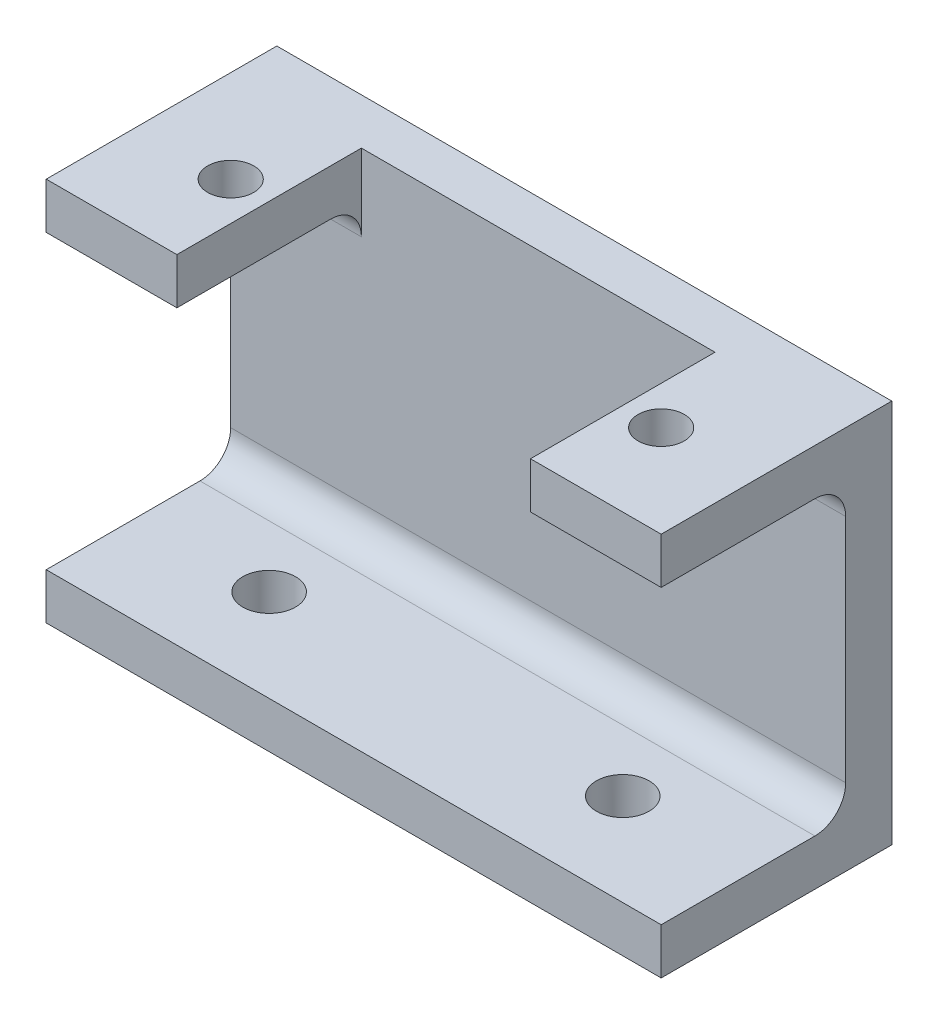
from build123d import *

# Parameters (mm, degrees)
ESQUISSE1_W             = 40
ESQUISSE1_H             = 25
BOSS_EXTRU_1_DEPTH      = 3
ESQUISSE2_W             = 40
ESQUISSE2_H             = 3
ESQUISSE2_W_2           = 8.5
BOSS_EXTRU_2_DEPTH      = 12
ENL_V_MAT_EXTRU_1_REACH = 35.829
ESQUISSE3_R             = 1.716468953
ENL_V_MAT_EXTRU_2_REACH = 37.852
ESQUISSE4_R             = 1.5
CONG_1_R                = 2


with BuildPart() as part:
    # Esquisse1 → Boss.-Extru.1 (new body)
    with BuildSketch(Plane.XY):
        with Locations((0.865603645, 0.074031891)):
            Rectangle(ESQUISSE1_W, ESQUISSE1_H)
    extrude(amount=BOSS_EXTRU_1_DEPTH)

    # Esquisse2 → Boss.-Extru.2 (add)
    with BuildSketch(Plane.XY.offset(3)):
        with Locations((0.865603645, -10.925968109)):
            Rectangle(ESQUISSE2_W, ESQUISSE2_H)
        with Locations((-14.884396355, 11.074031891)):
            Rectangle(ESQUISSE2_W_2, ESQUISSE2_H)
        with Locations((16.615603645, 11.074031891)):
            Rectangle(ESQUISSE2_W_2, ESQUISSE2_H)
    extrude(amount=BOSS_EXTRU_2_DEPTH)

    # Esquisse3 → Enl_v. mat.-Extru.1 (cut, up to next)
    with BuildSketch(Plane(origin=(0, -9.425968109, 0), x_dir=(1, 0, 0), z_dir=(0, 1, 0)), mode=Mode.PRIVATE) as enl_v_mat_extru_1_sk1:
        with Locations(Location((-10.634396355, -9, 0), (0, 0, 270))):
            Circle(ESQUISSE3_R)
    enl_v_mat_extru_1_tool1 = extrude(enl_v_mat_extru_1_sk1.sketch, amount=-ENL_V_MAT_EXTRU_1_REACH, mode=Mode.PRIVATE) & part.part
    # Esquisse3 → Enl_v. mat.-Extru.1 (cut, up to next)
    with BuildSketch(Plane(origin=(0, -9.425968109, 0), x_dir=(1, 0, 0), z_dir=(0, 1, 0)), mode=Mode.PRIVATE) as enl_v_mat_extru_1_sk2:
        with Locations(Location((12.365603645, -9, 0), (0, 0, 270))):
            Circle(ESQUISSE3_R)
    enl_v_mat_extru_1_tool2 = extrude(enl_v_mat_extru_1_sk2.sketch, amount=-ENL_V_MAT_EXTRU_1_REACH, mode=Mode.PRIVATE) & part.part
    add(enl_v_mat_extru_1_tool1.solids().sort_by_distance((-10.634396, -9.425968, 9))[0], mode=Mode.SUBTRACT)
    add(enl_v_mat_extru_1_tool2.solids().sort_by_distance((12.365604, -9.425968, 9))[0], mode=Mode.SUBTRACT)

    # Esquisse4 → Enl_v. mat.-Extru.2 (cut, up to next)
    with BuildSketch(Plane(origin=(0, 12.574031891, 0), x_dir=(1, 0, 0), z_dir=(0, 1, 0)), mode=Mode.PRIVATE) as enl_v_mat_extru_2_sk1:
        with Locations(Location((-13.134396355, -9, 0), (0, 0, 270))):
            Circle(ESQUISSE4_R)
    enl_v_mat_extru_2_tool1 = extrude(enl_v_mat_extru_2_sk1.sketch, amount=-ENL_V_MAT_EXTRU_2_REACH, mode=Mode.PRIVATE) & part.part
    # Esquisse4 → Enl_v. mat.-Extru.2 (cut, up to next)
    with BuildSketch(Plane(origin=(0, 12.574031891, 0), x_dir=(1, 0, 0), z_dir=(0, 1, 0)), mode=Mode.PRIVATE) as enl_v_mat_extru_2_sk2:
        with Locations(Location((14.865603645, -9, 0), (0, 0, 180))):
            Circle(ESQUISSE4_R)
    enl_v_mat_extru_2_tool2 = extrude(enl_v_mat_extru_2_sk2.sketch, amount=-ENL_V_MAT_EXTRU_2_REACH, mode=Mode.PRIVATE) & part.part
    add(enl_v_mat_extru_2_tool1.solids().sort_by_distance((-13.134396, 12.574032, 9))[0], mode=Mode.SUBTRACT)
    add(enl_v_mat_extru_2_tool2.solids().sort_by_distance((14.865604, 12.574032, 9))[0], mode=Mode.SUBTRACT)

    # Cong_1
    cong_1_edges = [part.edges().sort_by_distance(p)[0] for p in [
        (0.865603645, -9.425968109, 3),
        (-14.884396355, 9.574031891, 3),
        (16.615603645, 9.574031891, 3),
    ]]
    fillet(cong_1_edges, radius=CONG_1_R)


solid = part.part
